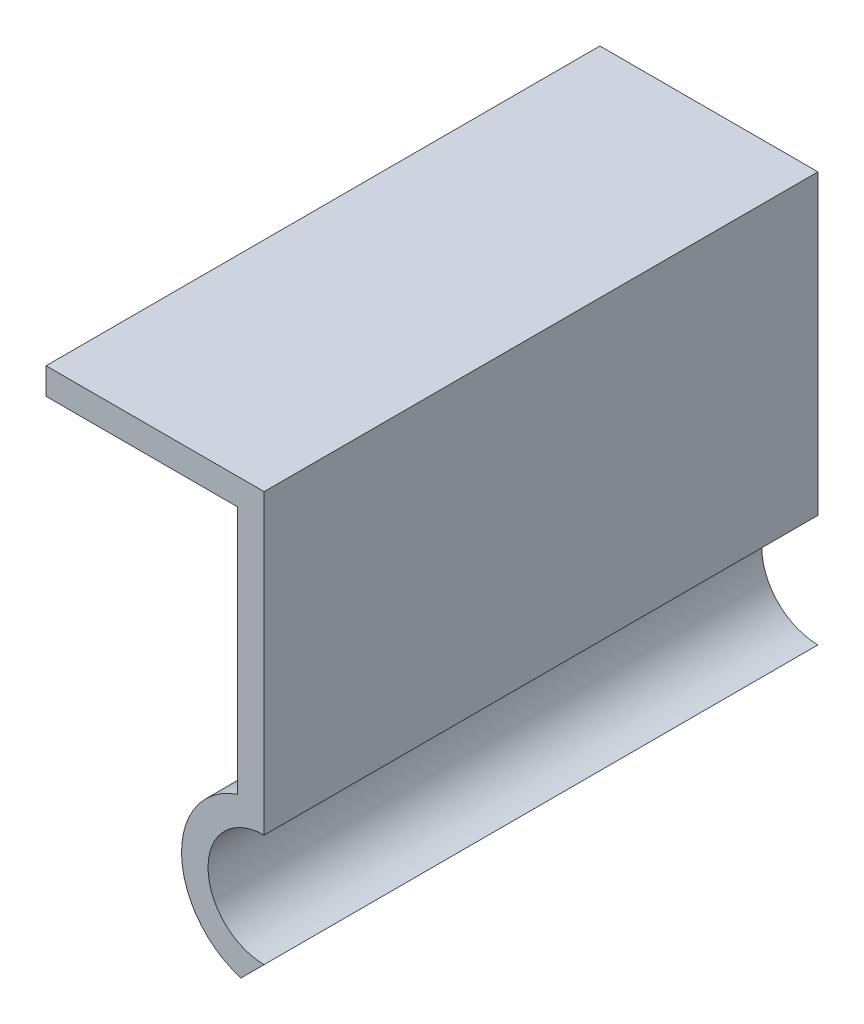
ISO-10303-21;
HEADER;
FILE_DESCRIPTION(('STEP AP214'),'2;1');
FILE_NAME('part.step','',(''),(''),'','','');
FILE_SCHEMA(('AUTOMOTIVE_DESIGN { 1 0 10303 214 1 1 1 1 }'));
ENDSEC;
DATA;
#1=APPLICATION_CONTEXT('core data for automotive mechanical design processes');
#2=APPLICATION_PROTOCOL_DEFINITION('international standard','automotive_design',2000,#1);
#3=PRODUCT_CONTEXT('',#1,'mechanical');
#4=PRODUCT('Part','Part','',(#3));
#5=PRODUCT_RELATED_PRODUCT_CATEGORY('part','',(#4));
#6=PRODUCT_DEFINITION_FORMATION('','',#4);
#7=PRODUCT_DEFINITION_CONTEXT('part definition',#1,'design');
#8=PRODUCT_DEFINITION('design','',#6,#7);
#9=PRODUCT_DEFINITION_SHAPE('','',#8);
#10=(LENGTH_UNIT() NAMED_UNIT(*) SI_UNIT(.MILLI.,.METRE.));
#11=(NAMED_UNIT(*) PLANE_ANGLE_UNIT() SI_UNIT($,.RADIAN.));
#12=(NAMED_UNIT(*) SI_UNIT($,.STERADIAN.) SOLID_ANGLE_UNIT());
#13=UNCERTAINTY_MEASURE_WITH_UNIT(LENGTH_MEASURE(1.E-05),#10,'distance_accuracy_value','');
#14=(GEOMETRIC_REPRESENTATION_CONTEXT(3) GLOBAL_UNCERTAINTY_ASSIGNED_CONTEXT((#13)) GLOBAL_UNIT_ASSIGNED_CONTEXT((#10,
#11,#12)) REPRESENTATION_CONTEXT('',''));
#15=CARTESIAN_POINT('',(0.,0.,0.));
#16=DIRECTION('',(0.,0.,1.));
#17=DIRECTION('',(1.,0.,0.));
#18=AXIS2_PLACEMENT_3D('',#15,#16,#17);
#19=CARTESIAN_POINT('',(0.,0.,25.4));
#20=DIRECTION('',(0.,-1.,0.));
#21=DIRECTION('',(1.,0.,0.));
#22=AXIS2_PLACEMENT_3D('',#19,#20,#21);
#23=PLANE('',#22);
#24=DIRECTION('',(-1.,0.,0.));
#25=VECTOR('',#24,1.);
#26=CARTESIAN_POINT('',(0.,0.,0.));
#27=LINE('',#26,#25);
#28=CARTESIAN_POINT('',(0.,0.,0.));
#29=VERTEX_POINT('',#28);
#30=CARTESIAN_POINT('',(-10.,0.,0.));
#31=VERTEX_POINT('',#30);
#32=EDGE_CURVE('E127',#29,#31,#27,.T.);
#33=ORIENTED_EDGE('',*,*,#32,.T.);
#34=DIRECTION('',(0.,0.,-1.));
#35=VECTOR('',#34,1.);
#36=CARTESIAN_POINT('',(-10.,0.,25.4));
#37=LINE('',#36,#35);
#38=CARTESIAN_POINT('',(-10.,0.,25.4));
#39=VERTEX_POINT('',#38);
#40=EDGE_CURVE('E11',#39,#31,#37,.T.);
#41=ORIENTED_EDGE('',*,*,#40,.F.);
#42=DIRECTION('',(-1.,0.,0.));
#43=VECTOR('',#42,1.);
#44=CARTESIAN_POINT('',(0.,0.,25.4));
#45=LINE('',#44,#43);
#46=CARTESIAN_POINT('',(0.,0.,25.4));
#47=VERTEX_POINT('',#46);
#48=EDGE_CURVE('E141',#47,#39,#45,.T.);
#49=ORIENTED_EDGE('',*,*,#48,.F.);
#50=DIRECTION('',(0.,0.,-1.));
#51=VECTOR('',#50,1.);
#52=CARTESIAN_POINT('',(0.,0.,25.4));
#53=LINE('',#52,#51);
#54=EDGE_CURVE('E123',#47,#29,#53,.T.);
#55=ORIENTED_EDGE('',*,*,#54,.T.);
#56=EDGE_LOOP('',(#33,#41,#49,#55));
#57=FACE_BOUND('',#56,.T.);
#58=ADVANCED_FACE('F31',(#57),#23,.F.);
#59=CARTESIAN_POINT('',(-10.,0.,25.4));
#60=DIRECTION('',(1.,0.,0.));
#61=DIRECTION('',(0.,0.,-1.));
#62=AXIS2_PLACEMENT_3D('',#59,#60,#61);
#63=PLANE('',#62);
#64=DIRECTION('',(0.,-1.,0.));
#65=VECTOR('',#64,1.);
#66=CARTESIAN_POINT('',(-10.,0.,0.));
#67=LINE('',#66,#65);
#68=CARTESIAN_POINT('',(-10.,-1.214,0.));
#69=VERTEX_POINT('',#68);
#70=EDGE_CURVE('E130',#31,#69,#67,.T.);
#71=ORIENTED_EDGE('',*,*,#70,.T.);
#72=DIRECTION('',(0.,0.,-1.));
#73=VECTOR('',#72,1.);
#74=CARTESIAN_POINT('',(-10.,-1.214,25.4));
#75=LINE('',#74,#73);
#76=CARTESIAN_POINT('',(-10.,-1.214,25.4));
#77=VERTEX_POINT('',#76);
#78=EDGE_CURVE('E39',#77,#69,#75,.T.);
#79=ORIENTED_EDGE('',*,*,#78,.F.);
#80=DIRECTION('',(0.,-1.,0.));
#81=VECTOR('',#80,1.);
#82=CARTESIAN_POINT('',(-10.,0.,25.4));
#83=LINE('',#82,#81);
#84=EDGE_CURVE('E90',#39,#77,#83,.T.);
#85=ORIENTED_EDGE('',*,*,#84,.F.);
#86=ORIENTED_EDGE('',*,*,#40,.T.);
#87=EDGE_LOOP('',(#71,#79,#85,#86));
#88=FACE_BOUND('',#87,.T.);
#89=ADVANCED_FACE('F176',(#88),#63,.F.);
#90=CARTESIAN_POINT('',(-1.214,-1.214,25.4));
#91=DIRECTION('',(0.,1.,0.));
#92=DIRECTION('',(-1.,0.,0.));
#93=AXIS2_PLACEMENT_3D('',#90,#91,#92);
#94=PLANE('',#93);
#95=DIRECTION('',(1.,0.,0.));
#96=VECTOR('',#95,1.);
#97=CARTESIAN_POINT('',(-1.214,-1.214,0.));
#98=LINE('',#97,#96);
#99=CARTESIAN_POINT('',(-1.214,-1.214,0.));
#100=VERTEX_POINT('',#99);
#101=EDGE_CURVE('E132',#69,#100,#98,.T.);
#102=ORIENTED_EDGE('',*,*,#101,.T.);
#103=DIRECTION('',(0.,0.,-1.));
#104=VECTOR('',#103,1.);
#105=CARTESIAN_POINT('',(-1.214,-1.214,25.4));
#106=LINE('',#105,#104);
#107=CARTESIAN_POINT('',(-1.214,-1.214,25.4));
#108=VERTEX_POINT('',#107);
#109=EDGE_CURVE('E148',#108,#100,#106,.T.);
#110=ORIENTED_EDGE('',*,*,#109,.F.);
#111=DIRECTION('',(1.,0.,0.));
#112=VECTOR('',#111,1.);
#113=CARTESIAN_POINT('',(-1.214,-1.214,25.4));
#114=LINE('',#113,#112);
#115=EDGE_CURVE('E156',#77,#108,#114,.T.);
#116=ORIENTED_EDGE('',*,*,#115,.F.);
#117=ORIENTED_EDGE('',*,*,#78,.T.);
#118=EDGE_LOOP('',(#102,#110,#116,#117));
#119=FACE_BOUND('',#118,.T.);
#120=ADVANCED_FACE('F154',(#119),#94,.F.);
#121=CARTESIAN_POINT('',(-1.214,-1.214,25.4));
#122=DIRECTION('',(1.,0.,0.));
#123=DIRECTION('',(0.,1.,0.));
#124=AXIS2_PLACEMENT_3D('',#121,#122,#123);
#125=PLANE('',#124);
#126=DIRECTION('',(0.,-1.,0.));
#127=VECTOR('',#126,1.);
#128=CARTESIAN_POINT('',(-1.214,-1.214,0.));
#129=LINE('',#128,#127);
#130=CARTESIAN_POINT('',(-1.214,-12.6279157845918,0.));
#131=VERTEX_POINT('',#130);
#132=EDGE_CURVE('E134',#100,#131,#129,.T.);
#133=ORIENTED_EDGE('',*,*,#132,.T.);
#134=DIRECTION('',(0.,0.,-1.));
#135=VECTOR('',#134,1.);
#136=CARTESIAN_POINT('',(-1.214,-12.6279157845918,25.4));
#137=LINE('',#136,#135);
#138=CARTESIAN_POINT('',(-1.214,-12.6279157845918,25.4));
#139=VERTEX_POINT('',#138);
#140=EDGE_CURVE('E145',#139,#131,#137,.T.);
#141=ORIENTED_EDGE('',*,*,#140,.F.);
#142=DIRECTION('',(0.,-1.,0.));
#143=VECTOR('',#142,1.);
#144=CARTESIAN_POINT('',(-1.214,-1.214,25.4));
#145=LINE('',#144,#143);
#146=EDGE_CURVE('E168',#108,#139,#145,.T.);
#147=ORIENTED_EDGE('',*,*,#146,.F.);
#148=ORIENTED_EDGE('',*,*,#109,.T.);
#149=EDGE_LOOP('',(#133,#141,#147,#148));
#150=FACE_BOUND('',#149,.T.);
#151=ADVANCED_FACE('F164',(#150),#125,.F.);
#152=CARTESIAN_POINT('',(0.,-16.214,25.4));
#153=DIRECTION('',(0.,0.,-1.));
#154=DIRECTION('',(-1.,0.,0.));
#155=AXIS2_PLACEMENT_3D('',#152,#153,#154);
#156=CYLINDRICAL_SURFACE('',#155,3.786);
#157=CARTESIAN_POINT('',(0.,-16.214,0.));
#158=DIRECTION('',(0.,0.,1.));
#159=DIRECTION('',(1.,0.,0.));
#160=AXIS2_PLACEMENT_3D('',#157,#158,#159);
#161=CIRCLE('',#160,3.786);
#162=CARTESIAN_POINT('',(-1.06199957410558,-19.8479995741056,0.));
#163=VERTEX_POINT('',#162);
#164=EDGE_CURVE('E136',#131,#163,#161,.T.);
#165=ORIENTED_EDGE('',*,*,#164,.T.);
#166=DIRECTION('',(0.,0.,-1.));
#167=VECTOR('',#166,1.);
#168=CARTESIAN_POINT('',(-1.06199957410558,-19.8479995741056,25.4));
#169=LINE('',#168,#167);
#170=CARTESIAN_POINT('',(-1.06199957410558,-19.8479995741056,25.4));
#171=VERTEX_POINT('',#170);
#172=EDGE_CURVE('E118',#171,#163,#169,.T.);
#173=ORIENTED_EDGE('',*,*,#172,.F.);
#174=CARTESIAN_POINT('',(0.,-16.214,25.4));
#175=DIRECTION('',(0.,0.,1.));
#176=DIRECTION('',(1.,0.,0.));
#177=AXIS2_PLACEMENT_3D('',#174,#175,#176);
#178=CIRCLE('',#177,3.786);
#179=EDGE_CURVE('E109',#139,#171,#178,.T.);
#180=ORIENTED_EDGE('',*,*,#179,.F.);
#181=ORIENTED_EDGE('',*,*,#140,.T.);
#182=EDGE_LOOP('',(#165,#173,#180,#181));
#183=FACE_BOUND('',#182,.T.);
#184=ADVANCED_FACE('F167',(#183),#156,.T.);
#185=CARTESIAN_POINT('',(0.,-18.786,25.4));
#186=DIRECTION('',(-0.707106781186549,0.707106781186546,0.));
#187=DIRECTION('',(-0.707106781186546,-0.707106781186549,0.));
#188=AXIS2_PLACEMENT_3D('',#185,#186,#187);
#189=PLANE('',#188);
#190=DIRECTION('',(0.707106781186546,0.707106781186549,0.));
#191=VECTOR('',#190,1.);
#192=CARTESIAN_POINT('',(0.,-18.786,0.));
#193=LINE('',#192,#191);
#194=CARTESIAN_POINT('',(0.,-18.786,0.));
#195=VERTEX_POINT('',#194);
#196=EDGE_CURVE('E117',#163,#195,#193,.T.);
#197=ORIENTED_EDGE('',*,*,#196,.T.);
#198=DIRECTION('',(0.,0.,-1.));
#199=VECTOR('',#198,1.);
#200=CARTESIAN_POINT('',(0.,-18.786,25.4));
#201=LINE('',#200,#199);
#202=CARTESIAN_POINT('',(0.,-18.786,25.4));
#203=VERTEX_POINT('',#202);
#204=EDGE_CURVE('E114',#203,#195,#201,.T.);
#205=ORIENTED_EDGE('',*,*,#204,.F.);
#206=DIRECTION('',(0.707106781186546,0.707106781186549,0.));
#207=VECTOR('',#206,1.);
#208=CARTESIAN_POINT('',(0.,-18.786,25.4));
#209=LINE('',#208,#207);
#210=EDGE_CURVE('E103',#171,#203,#209,.T.);
#211=ORIENTED_EDGE('',*,*,#210,.F.);
#212=ORIENTED_EDGE('',*,*,#172,.T.);
#213=EDGE_LOOP('',(#197,#205,#211,#212));
#214=FACE_BOUND('',#213,.T.);
#215=ADVANCED_FACE('F115',(#214),#189,.F.);
#216=CARTESIAN_POINT('',(0.,-16.214,25.4));
#217=DIRECTION('',(0.,0.,-1.));
#218=DIRECTION('',(-1.,0.,0.));
#219=AXIS2_PLACEMENT_3D('',#216,#217,#218);
#220=CYLINDRICAL_SURFACE('',#219,2.572);
#221=CARTESIAN_POINT('',(0.,-16.214,0.));
#222=DIRECTION('',(0.,0.,-1.));
#223=DIRECTION('',(1.,0.,0.));
#224=AXIS2_PLACEMENT_3D('',#221,#222,#223);
#225=CIRCLE('',#224,2.572);
#226=CARTESIAN_POINT('',(0.,-13.642,0.));
#227=VERTEX_POINT('',#226);
#228=EDGE_CURVE('E76',#195,#227,#225,.T.);
#229=ORIENTED_EDGE('',*,*,#228,.T.);
#230=DIRECTION('',(0.,0.,-1.));
#231=VECTOR('',#230,1.);
#232=CARTESIAN_POINT('',(0.,-13.642,25.4));
#233=LINE('',#232,#231);
#234=CARTESIAN_POINT('',(0.,-13.642,25.4));
#235=VERTEX_POINT('',#234);
#236=EDGE_CURVE('E119',#235,#227,#233,.T.);
#237=ORIENTED_EDGE('',*,*,#236,.F.);
#238=CARTESIAN_POINT('',(0.,-16.214,25.4));
#239=DIRECTION('',(0.,0.,-1.));
#240=DIRECTION('',(1.,0.,0.));
#241=AXIS2_PLACEMENT_3D('',#238,#239,#240);
#242=CIRCLE('',#241,2.572);
#243=EDGE_CURVE('E107',#203,#235,#242,.T.);
#244=ORIENTED_EDGE('',*,*,#243,.F.);
#245=ORIENTED_EDGE('',*,*,#204,.T.);
#246=EDGE_LOOP('',(#229,#237,#244,#245));
#247=FACE_BOUND('',#246,.T.);
#248=ADVANCED_FACE('F121',(#247),#220,.F.);
#249=CARTESIAN_POINT('',(0.,0.,25.4));
#250=DIRECTION('',(-1.,0.,0.));
#251=DIRECTION('',(0.,-1.,0.));
#252=AXIS2_PLACEMENT_3D('',#249,#250,#251);
#253=PLANE('',#252);
#254=DIRECTION('',(0.,1.,0.));
#255=VECTOR('',#254,1.);
#256=CARTESIAN_POINT('',(0.,0.,0.));
#257=LINE('',#256,#255);
#258=EDGE_CURVE('E82',#227,#29,#257,.T.);
#259=ORIENTED_EDGE('',*,*,#258,.T.);
#260=ORIENTED_EDGE('',*,*,#54,.F.);
#261=DIRECTION('',(0.,1.,0.));
#262=VECTOR('',#261,1.);
#263=CARTESIAN_POINT('',(0.,0.,25.4));
#264=LINE('',#263,#262);
#265=EDGE_CURVE('E47',#235,#47,#264,.T.);
#266=ORIENTED_EDGE('',*,*,#265,.F.);
#267=ORIENTED_EDGE('',*,*,#236,.T.);
#268=EDGE_LOOP('',(#259,#260,#266,#267));
#269=FACE_BOUND('',#268,.T.);
#270=ADVANCED_FACE('F192',(#269),#253,.F.);
#271=CARTESIAN_POINT('',(0.,-16.214,25.4));
#272=DIRECTION('',(0.,0.,1.));
#273=DIRECTION('',(1.,0.,0.));
#274=AXIS2_PLACEMENT_3D('',#271,#272,#273);
#275=PLANE('',#274);
#276=ORIENTED_EDGE('',*,*,#48,.T.);
#277=ORIENTED_EDGE('',*,*,#84,.T.);
#278=ORIENTED_EDGE('',*,*,#115,.T.);
#279=ORIENTED_EDGE('',*,*,#146,.T.);
#280=ORIENTED_EDGE('',*,*,#179,.T.);
#281=ORIENTED_EDGE('',*,*,#210,.T.);
#282=ORIENTED_EDGE('',*,*,#243,.T.);
#283=ORIENTED_EDGE('',*,*,#265,.T.);
#284=EDGE_LOOP('',(#276,#277,#278,#279,#280,#281,#282,#283));
#285=FACE_BOUND('',#284,.T.);
#286=ADVANCED_FACE('F105',(#285),#275,.T.);
#287=CARTESIAN_POINT('',(0.,-16.214,0.));
#288=DIRECTION('',(0.,0.,1.));
#289=DIRECTION('',(1.,0.,0.));
#290=AXIS2_PLACEMENT_3D('',#287,#288,#289);
#291=PLANE('',#290);
#292=ORIENTED_EDGE('',*,*,#32,.F.);
#293=ORIENTED_EDGE('',*,*,#258,.F.);
#294=ORIENTED_EDGE('',*,*,#228,.F.);
#295=ORIENTED_EDGE('',*,*,#196,.F.);
#296=ORIENTED_EDGE('',*,*,#164,.F.);
#297=ORIENTED_EDGE('',*,*,#132,.F.);
#298=ORIENTED_EDGE('',*,*,#101,.F.);
#299=ORIENTED_EDGE('',*,*,#70,.F.);
#300=EDGE_LOOP('',(#292,#293,#294,#295,#296,#297,#298,#299));
#301=FACE_BOUND('',#300,.T.);
#302=ADVANCED_FACE('F160',(#301),#291,.F.);
#303=CLOSED_SHELL('',(#58,#89,#120,#151,#184,#215,#248,#270,#286,#302));
#304=MANIFOLD_SOLID_BREP('B2',#303);
#305=ADVANCED_BREP_SHAPE_REPRESENTATION('',(#18,#304),#14);
#306=SHAPE_DEFINITION_REPRESENTATION(#9,#305);
ENDSEC;
END-ISO-10303-21;
